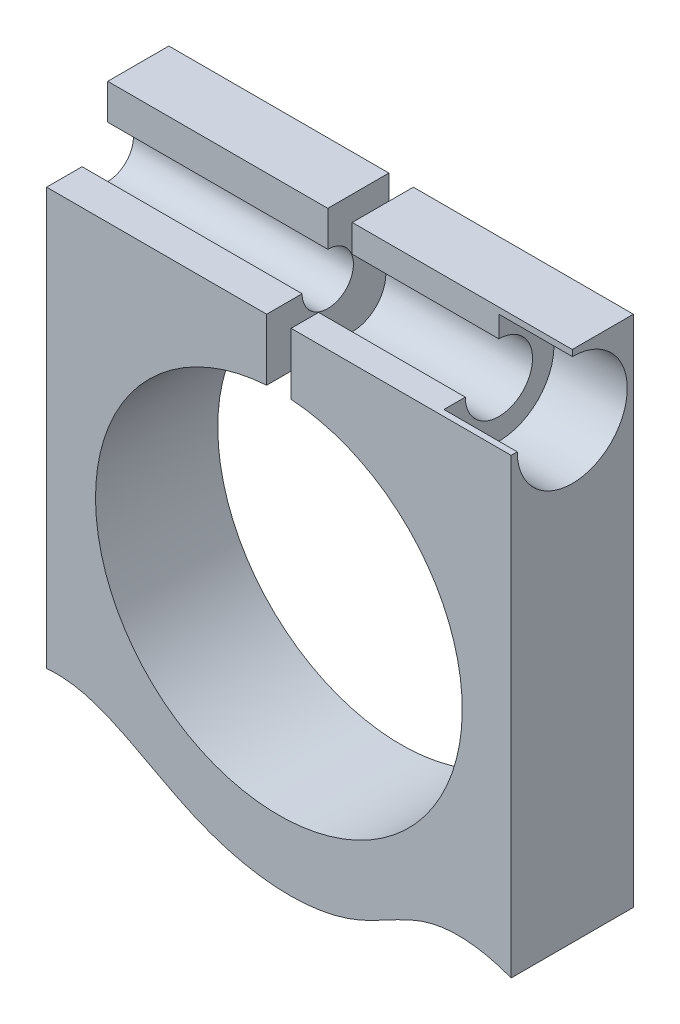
from build123d import *

# Parameters (mm, degrees)
EXTRUSION1_DEPTH        = 10
ESQUISSE2_W             = 2.1
ESQUISSE2_H             = 18
ESQUISSE6_R             = 4.5
ENL_V_MAT_EXTRU_1_DEPTH = 6
ESQUISSE7_R             = 2.75
ENL_V_MAT_EXTRU_2_DEPTH = 12
ESQUISSE10_W            = 5
ESQUISSE10_H            = 5
ENL_V_MAT_EXTRU_3_DEPTH = 45
ENL_V_MAT_EXTRU_4_DEPTH = 10


with BuildPart() as part:
    # Esquisse1 → Extrusion1 (new body)
    with BuildSketch(Plane.XY):
        with BuildLine():
            Line((1, 25), (19, 25))
            Line((19, 25), (19, -45))
            Line((19, -45), (-19, -45))
            Line((-19, -45), (-19, 25))
            Line((-19, 25), (-1, 25))
            Line((-1, 25), (-1, 14.966629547))
            ThreePointArc((-1, 14.966629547), (0, -15), (1, 14.966629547))
            Line((1, 14.966629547), (1, 25))
        make_face()
    extrude(amount=EXTRUSION1_DEPTH)

    # Esquisse2 → Trou taraud_ M51 (revolve, cut)
    with BuildSketch(Plane(origin=(-1, 20, 5), x_dir=(0, 0, -1), z_dir=(0, 1, 0))):
        with Locations((1.05, 9)):
            Rectangle(ESQUISSE2_W, ESQUISSE2_H)
    revolve(axis=Axis((5.35, 20, 5), (-1, 0, 0)), mode=Mode.SUBTRACT)

    # Esquisse6 → Enl_v. mat.-Extru.1 (cut)
    with BuildSketch(Plane(origin=(19, 0, 0), x_dir=(0, 0, -1), z_dir=(1, 0, 0))):
        with Locations(Location((-5, 20, 0), (0, 0, 90))):
            Circle(ESQUISSE6_R)
    extrude(amount=-ENL_V_MAT_EXTRU_1_DEPTH, mode=Mode.SUBTRACT)

    # Esquisse7 → Enl_v. mat.-Extru.2 (cut)
    with BuildSketch(Plane(origin=(13, 0, 0), x_dir=(0, 0, -1), z_dir=(1, 0, 0))):
        with Locations(Location((-5, 20, 0), (0, 0, 90))):
            Circle(ESQUISSE7_R)
    extrude(amount=-ENL_V_MAT_EXTRU_2_DEPTH, mode=Mode.SUBTRACT)

    # Esquisse10 → Enl_v. mat.-Extru.3 (cut)
    with BuildSketch(Plane(origin=(19, 0, 0), x_dir=(0, 0, -1), z_dir=(1, 0, 0))):
        with Locations((-7.5, 22.5)):
            Rectangle(ESQUISSE10_W, ESQUISSE10_H)
    extrude(amount=-ENL_V_MAT_EXTRU_3_DEPTH, mode=Mode.SUBTRACT)

    # Esquisse12 → Enl_v. mat.-Extru.4 (cut)
    with BuildSketch(Plane.XY.offset(10)):
        with BuildLine():
            add(Edge.make_bspline(
                [(-32.750084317, -22.352107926), (-27.647517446, -17.402207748), (-18.569989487, -10.738552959), (-6.333431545, -20.115819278), (4.835722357, -21.026723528), (13.3896338, -14.714011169), (31.608426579, -20.724999), (27.002290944, -58.744860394), (-10.00488378, -62.069124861), (-54.297267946, -49.045105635), (-39.412613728, -28.815297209), (-32.750084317, -22.352107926)],
                knots=[0, 0, 0, 0, 0.0968812, 0.156812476, 0.226225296, 0.26107544, 0.320423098, 0.482291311, 0.675383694, 0.87350017, 1, 1, 1, 1], degree=3))
        make_face()
    extrude(amount=-ENL_V_MAT_EXTRU_4_DEPTH, mode=Mode.SUBTRACT)


solid = part.part
